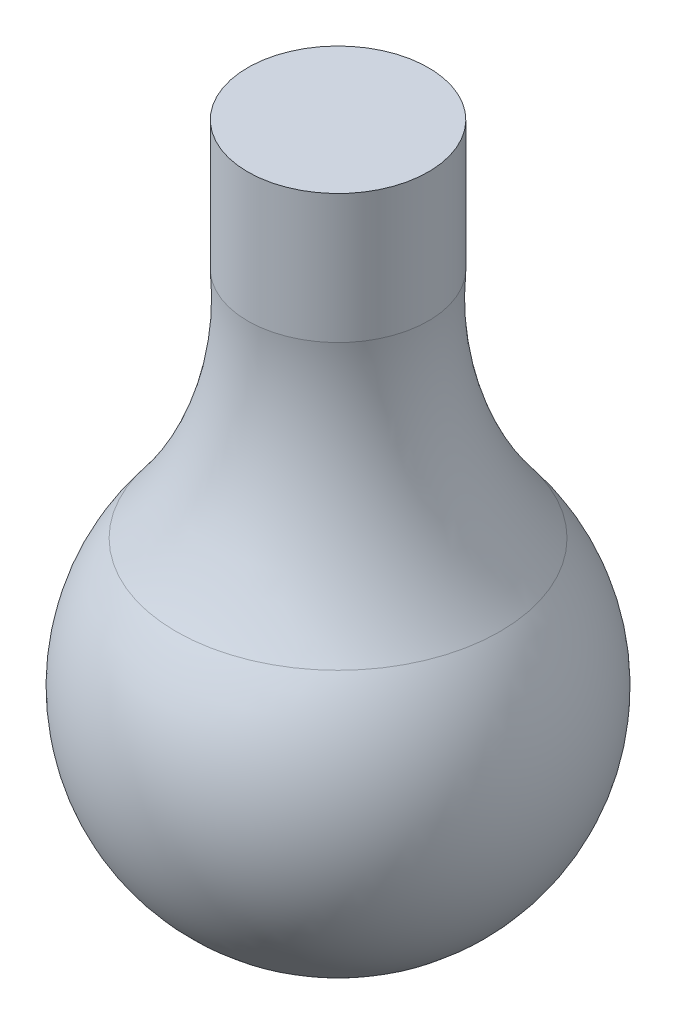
from build123d import *

# Parameters (mm, degrees)
SKETCH1_R           = 3.5
BOSS_EXTRUDE1_DEPTH = 5


with BuildPart() as part:
    # Sketch1 → Boss-Extrude1 (new body)
    with BuildSketch(Plane(origin=(0, 0, 0), x_dir=(1, 0, 0), z_dir=(0, 1, 0))):
        with Locations(Location((0, 0, 0), (0, 0, 270))):
            Circle(SKETCH1_R)
    extrude(amount=BOSS_EXTRUDE1_DEPTH)


with BuildPart() as body_2:
    # Sketch2 → Revolve1 (revolve)
    with BuildSketch(Plane.XY, mode=Mode.PRIVATE) as revolve1_sk:
        with BuildLine():
            Line((0, -22), (0, 0))
            Line((0, 0), (3.5, 0))
            ThreePointArc((3.5, 0), (4.036118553, -4.777798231), (6.272072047, -9.034004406))
            ThreePointArc((6.272072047, -9.034004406), (7.20166525, -17.483678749), (0, -22))
        make_face()
    revolve(revolve1_sk.sketch.rotate(Axis((0, 5.790851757, 0), (0, -1, 0)), 90), axis=Axis((0, 5.790851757, 0), (0, -1, 0)))


solid = Compound([part.part, body_2.part])
